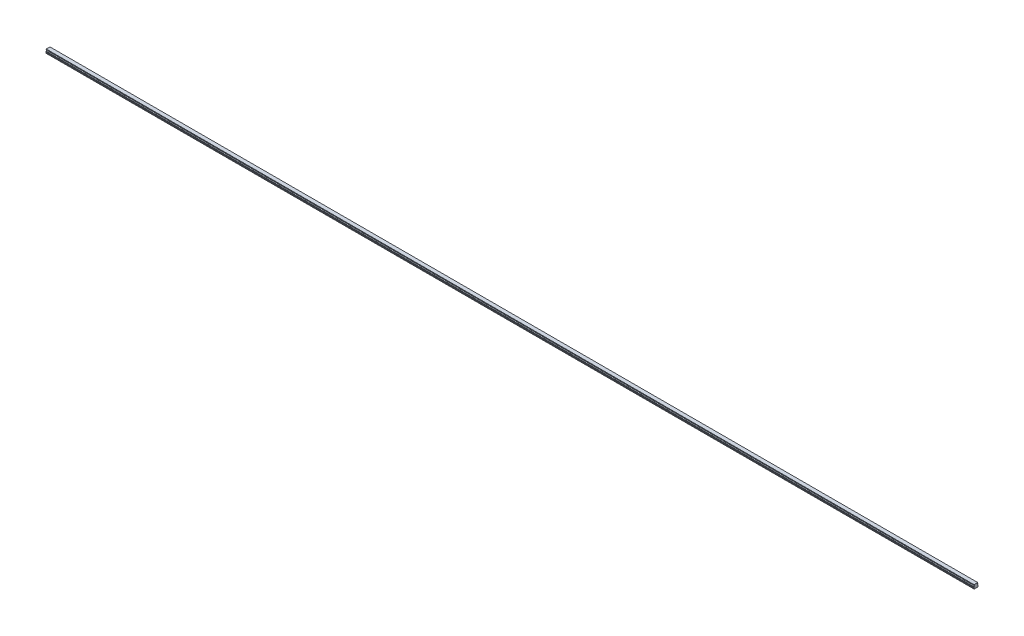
from build123d import *

# Parameters (mm, degrees)
BOSS_EXTRUDE1_DEPTH        = 3300
SKETCH3_R                  = 2.5
SKETCH3_R_2                = 2.1
CUT_EXTRUDE3_DEPTH         = 7
SKETCH3_2_R                = 2.1
CUT_EXTRUDE4_DEPTH         = 9.5
CHAMFER1_SIZE              = 0.4
LPATTERN2_COUNT            = 55
LPATTERN2_PITCH            = 60
CHAMFER1_OF_LPATTERN2_SIZE = 0.4


with BuildPart() as part:
    # Sketch1 → Boss-Extrude1 (new body)
    with BuildSketch(Plane(origin=(0, 0, 0), x_dir=(0, 0, -1), z_dir=(1, 0, 0))):
        with BuildLine():
            Line((6.59, 14), (-6.59, 14))
            Line((-6.59, 14), (-6.59, 13.15))
            Line((-6.59, 13.15), (-6.96, 12.356532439))
            Line((-6.96, 12.356532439), (-6.96, 11.435174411))
            ThreePointArc((-6.96, 11.435174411), (-5.25, 9.5), (-6.96, 7.564825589))
            Line((-6.96, 7.564825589), (-6.96, 6.643467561))
            Line((-6.96, 6.643467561), (-6.59, 5.85))
            Line((-6.59, 5.85), (-7.032116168, 4.2))
            Line((-7.032116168, 4.2), (-7.5, 3.929867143))
            Line((-7.5, 3.929867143), (-7.5, 1.4))
            Line((-7.5, 1.4), (-6.1, 0))
            Line((-6.1, 0), (-3.65, 0))
            Line((-3.65, 0), (-3.25, 0.4))
            Line((-3.25, 0.4), (3.25, 0.4))
            Line((3.25, 0.4), (3.65, 0))
            Line((3.65, 0), (6.1, 0))
            Line((6.1, 0), (7.5, 1.4))
            Line((7.5, 1.4), (7.5, 3.929867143))
            Line((7.5, 3.929867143), (7.032116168, 4.2))
            Line((7.032116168, 4.2), (6.59, 5.85))
            Line((6.59, 5.85), (6.96, 6.643467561))
            Line((6.96, 6.643467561), (6.96, 7.564825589))
            ThreePointArc((6.96, 7.564825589), (5.25, 9.5), (6.96, 11.435174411))
            Line((6.96, 11.435174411), (6.96, 12.356532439))
            Line((6.96, 12.356532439), (6.59, 13.15))
            Line((6.59, 13.15), (6.59, 14))
        make_face()
    extrude(amount=BOSS_EXTRUDE1_DEPTH)

    # Sketch3 → Cut-Extrude3 (cut)
    with BuildSketch(Plane.XZ):
        with Locations(Location((30, 0, 0), (0, 0, 270))):
            Circle(SKETCH3_R)
        with Locations(Location((30, 0, 0), (0, 0, 270))):
            Circle(SKETCH3_R_2, mode=Mode.SUBTRACT)
    cut_extrude3 = extrude(amount=-CUT_EXTRUDE3_DEPTH, mode=Mode.SUBTRACT)

    # Sketch3_2 → Cut-Extrude4 (cut)
    with BuildSketch(Plane.XZ):
        with Locations(Location((30, 0, 0), (0, 0, 270))):
            Circle(SKETCH3_2_R)
    cut_extrude4 = extrude(amount=-CUT_EXTRUDE4_DEPTH, mode=Mode.SUBTRACT)

    # Cut-Extrude5 cone 1 section (on through the dimple's axis) → Cut-Extrude5 (revolve, cut)
    with BuildSketch(Plane(origin=(30, 9.5, 0), x_dir=(0, 0, -1), z_dir=(1, 0, 0))):
        Polygon((0, 0), (2.1, 0), (0, 1.212435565), align=None)
    revolve(axis=Axis((30, 9.5, 0), (0, 1, 0)), mode=Mode.SUBTRACT)

    # Chamfer1
    chamfer1_edges = [part.edges().sort_by_distance(p)[0] for p in [
        (30, 0.4, 2.5),
    ]]
    chamfer(chamfer1_edges, length=CHAMFER1_SIZE)

    # LPattern2: Cut-Extrude3, Cut-Extrude4 ×55
    with Locations(*[(i * LPATTERN2_PITCH, 0, 0) for i in range(1, LPATTERN2_COUNT)]):
        add(cut_extrude3, mode=Mode.SUBTRACT)
        add(cut_extrude4, mode=Mode.SUBTRACT)

    # Chamfer1 of LPattern2
    chamfer1_of_lpattern2_edges = [part.edges().sort_by_distance(p)[0] for p in [
        (90, 0.4, 2.5),
        (150, 0.4, 2.5),
        (210, 0.4, 2.5),
        (270, 0.4, 2.5),
        (330, 0.4, 2.5),
        (390, 0.4, 2.5),
        (450, 0.4, 2.5),
        (510, 0.4, 2.5),
        (570, 0.4, 2.5),
        (630, 0.4, 2.5),
        (690, 0.4, 2.5),
        (750, 0.4, 2.5),
        (810, 0.4, 2.5),
        (870, 0.4, 2.5),
        (930, 0.4, 2.5),
        (990, 0.4, 2.5),
        (1050, 0.4, 2.5),
        (1110, 0.4, 2.5),
        (1170, 0.4, 2.5),
        (1230, 0.4, 2.5),
        (1290, 0.4, 2.5),
        (1350, 0.4, 2.5),
        (1410, 0.4, 2.5),
        (1470, 0.4, 2.5),
        (1530, 0.4, 2.5),
        (1590, 0.4, 2.5),
        (1650, 0.4, 2.5),
        (1710, 0.4, 2.5),
        (1770, 0.4, 2.5),
        (1830, 0.4, 2.5),
        (1890, 0.4, 2.5),
        (1950, 0.4, 2.5),
        (2010, 0.4, 2.5),
        (2070, 0.4, 2.5),
        (2130, 0.4, 2.5),
        (2190, 0.4, 2.5),
        (2250, 0.4, 2.5),
        (2310, 0.4, 2.5),
        (2370, 0.4, 2.5),
        (2430, 0.4, 2.5),
        (2490, 0.4, 2.5),
        (2550, 0.4, 2.5),
        (2610, 0.4, 2.5),
        (2670, 0.4, 2.5),
        (2730, 0.4, 2.5),
        (2790, 0.4, 2.5),
        (2850, 0.4, 2.5),
        (2910, 0.4, 2.5),
        (2970, 0.4, 2.5),
        (3030, 0.4, 2.5),
        (3090, 0.4, 2.5),
        (3150, 0.4, 2.5),
        (3210, 0.4, 2.5),
        (3270, 0.4, 2.5),
    ]]
    chamfer(chamfer1_of_lpattern2_edges, length=CHAMFER1_OF_LPATTERN2_SIZE)


solid = part.part
